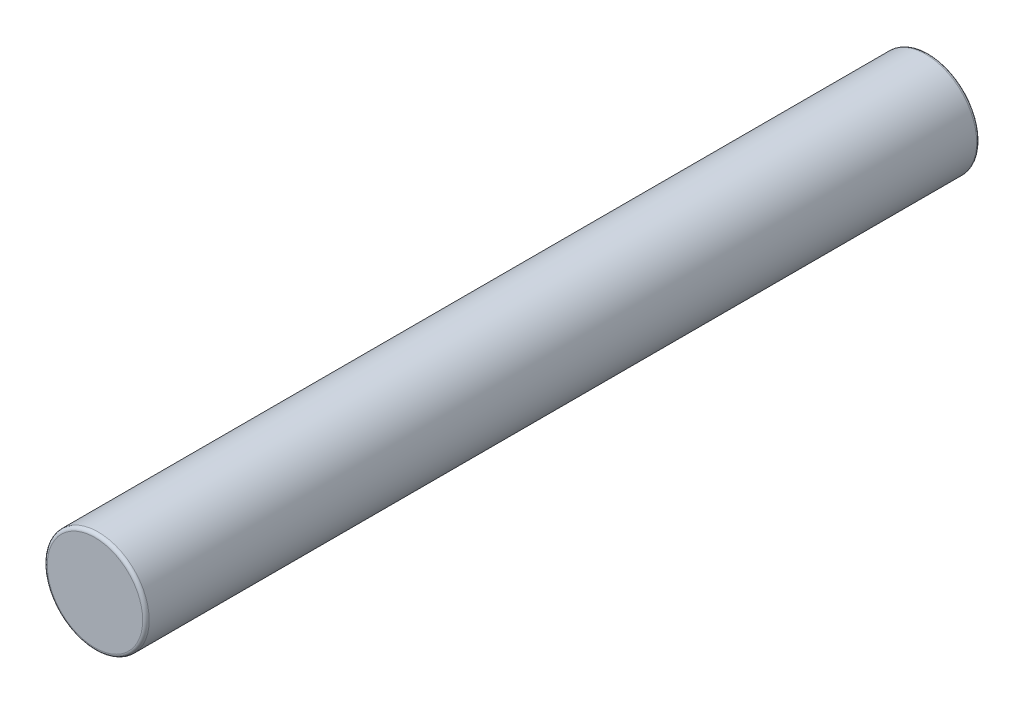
ISO-10303-21;
HEADER;
FILE_DESCRIPTION(('STEP AP214'),'2;1');
FILE_NAME('part.step','',(''),(''),'','','');
FILE_SCHEMA(('AUTOMOTIVE_DESIGN { 1 0 10303 214 1 1 1 1 }'));
ENDSEC;
DATA;
#1=APPLICATION_CONTEXT('core data for automotive mechanical design processes');
#2=APPLICATION_PROTOCOL_DEFINITION('international standard','automotive_design',2000,#1);
#3=PRODUCT_CONTEXT('',#1,'mechanical');
#4=PRODUCT('Part','Part','',(#3));
#5=PRODUCT_RELATED_PRODUCT_CATEGORY('part','',(#4));
#6=PRODUCT_DEFINITION_FORMATION('','',#4);
#7=PRODUCT_DEFINITION_CONTEXT('part definition',#1,'design');
#8=PRODUCT_DEFINITION('design','',#6,#7);
#9=PRODUCT_DEFINITION_SHAPE('','',#8);
#10=(LENGTH_UNIT() NAMED_UNIT(*) SI_UNIT(.MILLI.,.METRE.));
#11=(NAMED_UNIT(*) PLANE_ANGLE_UNIT() SI_UNIT($,.RADIAN.));
#12=(NAMED_UNIT(*) SI_UNIT($,.STERADIAN.) SOLID_ANGLE_UNIT());
#13=UNCERTAINTY_MEASURE_WITH_UNIT(LENGTH_MEASURE(1.E-05),#10,'distance_accuracy_value','');
#14=(GEOMETRIC_REPRESENTATION_CONTEXT(3) GLOBAL_UNCERTAINTY_ASSIGNED_CONTEXT((#13)) GLOBAL_UNIT_ASSIGNED_CONTEXT((#10,
#11,#12)) REPRESENTATION_CONTEXT('',''));
#15=CARTESIAN_POINT('',(0.,0.,0.));
#16=DIRECTION('',(0.,0.,1.));
#17=DIRECTION('',(1.,0.,0.));
#18=AXIS2_PLACEMENT_3D('',#15,#16,#17);
#19=CARTESIAN_POINT('',(0.,0.,16.2306));
#20=DIRECTION('',(0.,0.,-1.));
#21=DIRECTION('',(-1.,0.,0.));
#22=AXIS2_PLACEMENT_3D('',#19,#20,#21);
#23=CYLINDRICAL_SURFACE('',#22,1.984375);
#24=CARTESIAN_POINT('',(0.,0.,16.1036));
#25=DIRECTION('',(0.,0.,1.));
#26=DIRECTION('',(1.,0.,0.));
#27=AXIS2_PLACEMENT_3D('',#24,#25,#26);
#28=CIRCLE('',#27,1.984375);
#29=CARTESIAN_POINT('',(1.984375,0.,16.1036));
#30=VERTEX_POINT('',#29);
#31=EDGE_CURVE('E37',#30,#30,#28,.F.);
#32=ORIENTED_EDGE('',*,*,#31,.T.);
#33=EDGE_LOOP('',(#32));
#34=FACE_BOUND('',#33,.T.);
#35=CARTESIAN_POINT('',(0.,0.,-16.1036));
#36=DIRECTION('',(0.,0.,1.));
#37=DIRECTION('',(1.,0.,0.));
#38=AXIS2_PLACEMENT_3D('',#35,#36,#37);
#39=CIRCLE('',#38,1.984375);
#40=CARTESIAN_POINT('',(1.984375,0.,-16.1036));
#41=VERTEX_POINT('',#40);
#42=EDGE_CURVE('E41',#41,#41,#39,.T.);
#43=ORIENTED_EDGE('',*,*,#42,.T.);
#44=EDGE_LOOP('',(#43));
#45=FACE_BOUND('',#44,.T.);
#46=ADVANCED_FACE('F30',(#34,#45),#23,.T.);
#47=CARTESIAN_POINT('',(0.,0.,16.2306));
#48=DIRECTION('',(0.,0.,1.));
#49=DIRECTION('',(1.,0.,0.));
#50=AXIS2_PLACEMENT_3D('',#47,#48,#49);
#51=PLANE('',#50);
#52=CARTESIAN_POINT('',(0.,0.,16.2306));
#53=DIRECTION('',(0.,0.,1.));
#54=DIRECTION('',(1.,0.,0.));
#55=AXIS2_PLACEMENT_3D('',#52,#53,#54);
#56=CIRCLE('',#55,1.857375);
#57=CARTESIAN_POINT('',(1.857375,0.,16.2306));
#58=VERTEX_POINT('',#57);
#59=EDGE_CURVE('E45',#58,#58,#56,.T.);
#60=ORIENTED_EDGE('',*,*,#59,.T.);
#61=EDGE_LOOP('',(#60));
#62=FACE_BOUND('',#61,.T.);
#63=ADVANCED_FACE('F51',(#62),#51,.T.);
#64=CARTESIAN_POINT('',(0.,0.,-16.2306));
#65=DIRECTION('',(0.,0.,1.));
#66=DIRECTION('',(1.,0.,0.));
#67=AXIS2_PLACEMENT_3D('',#64,#65,#66);
#68=PLANE('',#67);
#69=CARTESIAN_POINT('',(0.,0.,-16.2306));
#70=DIRECTION('',(0.,0.,1.));
#71=DIRECTION('',(1.,0.,0.));
#72=AXIS2_PLACEMENT_3D('',#69,#70,#71);
#73=CIRCLE('',#72,1.857375);
#74=CARTESIAN_POINT('',(1.857375,0.,-16.2306));
#75=VERTEX_POINT('',#74);
#76=EDGE_CURVE('E10',#75,#75,#73,.F.);
#77=ORIENTED_EDGE('',*,*,#76,.T.);
#78=EDGE_LOOP('',(#77));
#79=FACE_BOUND('',#78,.T.);
#80=ADVANCED_FACE('F55',(#79),#68,.F.);
#81=CARTESIAN_POINT('',(0.,0.,16.1036));
#82=DIRECTION('',(0.,0.,1.));
#83=DIRECTION('',(1.,0.,0.));
#84=AXIS2_PLACEMENT_3D('',#81,#82,#83);
#85=TOROIDAL_SURFACE('',#84,1.857375,0.127);
#86=ORIENTED_EDGE('',*,*,#31,.F.);
#87=EDGE_LOOP('',(#86));
#88=FACE_BOUND('',#87,.T.);
#89=ORIENTED_EDGE('',*,*,#59,.F.);
#90=EDGE_LOOP('',(#89));
#91=FACE_BOUND('',#90,.T.);
#92=ADVANCED_FACE('F53',(#88,#91),#85,.T.);
#93=CARTESIAN_POINT('',(0.,0.,-16.1036));
#94=DIRECTION('',(0.,0.,1.));
#95=DIRECTION('',(1.,0.,0.));
#96=AXIS2_PLACEMENT_3D('',#93,#94,#95);
#97=TOROIDAL_SURFACE('',#96,1.857375,0.127);
#98=ORIENTED_EDGE('',*,*,#76,.F.);
#99=EDGE_LOOP('',(#98));
#100=FACE_BOUND('',#99,.T.);
#101=ORIENTED_EDGE('',*,*,#42,.F.);
#102=EDGE_LOOP('',(#101));
#103=FACE_BOUND('',#102,.T.);
#104=ADVANCED_FACE('F32',(#100,#103),#97,.T.);
#105=CLOSED_SHELL('',(#46,#63,#80,#92,#104));
#106=MANIFOLD_SOLID_BREP('B2',#105);
#107=ADVANCED_BREP_SHAPE_REPRESENTATION('',(#18,#106),#14);
#108=SHAPE_DEFINITION_REPRESENTATION(#9,#107);
ENDSEC;
END-ISO-10303-21;
